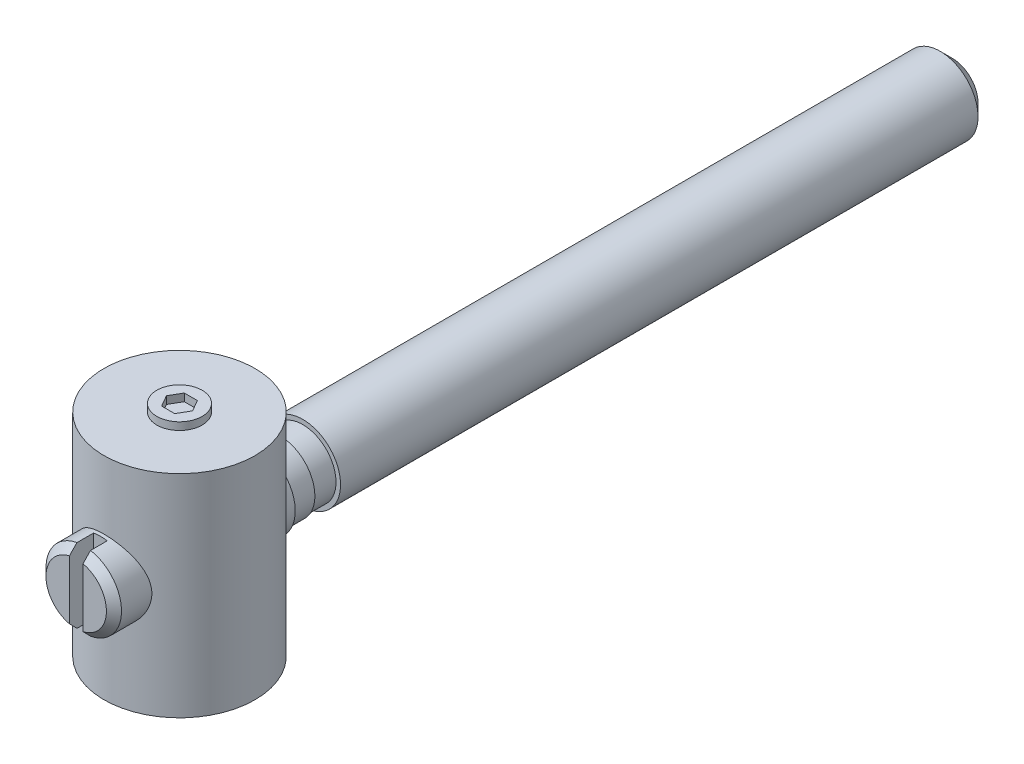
ISO-10303-21;
HEADER;
FILE_DESCRIPTION(('STEP AP214'),'2;1');
FILE_NAME('part.step','',(''),(''),'','','');
FILE_SCHEMA(('AUTOMOTIVE_DESIGN { 1 0 10303 214 1 1 1 1 }'));
ENDSEC;
DATA;
#1=APPLICATION_CONTEXT('core data for automotive mechanical design processes');
#2=APPLICATION_PROTOCOL_DEFINITION('international standard','automotive_design',2000,#1);
#3=PRODUCT_CONTEXT('',#1,'mechanical');
#4=PRODUCT('Part','Part','',(#3));
#5=PRODUCT_RELATED_PRODUCT_CATEGORY('part','',(#4));
#6=PRODUCT_DEFINITION_FORMATION('','',#4);
#7=PRODUCT_DEFINITION_CONTEXT('part definition',#1,'design');
#8=PRODUCT_DEFINITION('design','',#6,#7);
#9=PRODUCT_DEFINITION_SHAPE('','',#8);
#10=(LENGTH_UNIT() NAMED_UNIT(*) SI_UNIT(.MILLI.,.METRE.));
#11=(NAMED_UNIT(*) PLANE_ANGLE_UNIT() SI_UNIT($,.RADIAN.));
#12=(NAMED_UNIT(*) SI_UNIT($,.STERADIAN.) SOLID_ANGLE_UNIT());
#13=UNCERTAINTY_MEASURE_WITH_UNIT(LENGTH_MEASURE(1.E-05),#10,'distance_accuracy_value','');
#14=(GEOMETRIC_REPRESENTATION_CONTEXT(3) GLOBAL_UNCERTAINTY_ASSIGNED_CONTEXT((#13)) GLOBAL_UNIT_ASSIGNED_CONTEXT((#10,
#11,#12)) REPRESENTATION_CONTEXT('',''));
#15=CARTESIAN_POINT('',(0.,0.,0.));
#16=DIRECTION('',(0.,0.,1.));
#17=DIRECTION('',(1.,0.,0.));
#18=AXIS2_PLACEMENT_3D('',#15,#16,#17);
#19=CARTESIAN_POINT('',(0.,0.,6.8376561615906));
#20=DIRECTION('',(0.,0.,-1.));
#21=DIRECTION('',(0.,1.,0.));
#22=AXIS2_PLACEMENT_3D('',#19,#20,#21);
#23=PLANE('',#22);
#24=CARTESIAN_POINT('',(0.,0.,6.8376561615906));
#25=DIRECTION('',(0.,0.,-1.));
#26=DIRECTION('',(0.,1.,0.));
#27=AXIS2_PLACEMENT_3D('',#24,#25,#26);
#28=CIRCLE('',#27,2.);
#29=CARTESIAN_POINT('',(0.45,-1.94871752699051,6.8376561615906));
#30=VERTEX_POINT('',#29);
#31=CARTESIAN_POINT('',(0.45,1.94871752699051,6.8376561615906));
#32=VERTEX_POINT('',#31);
#33=EDGE_CURVE('E145',#30,#32,#28,.F.);
#34=ORIENTED_EDGE('',*,*,#33,.T.);
#35=DIRECTION('',(0.,1.,0.));
#36=VECTOR('',#35,1.);
#37=CARTESIAN_POINT('',(0.45,2.4591665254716,6.8376561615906));
#38=LINE('',#37,#36);
#39=EDGE_CURVE('E33',#30,#32,#38,.T.);
#40=ORIENTED_EDGE('',*,*,#39,.F.);
#41=EDGE_LOOP('',(#34,#40));
#42=FACE_BOUND('',#41,.T.);
#43=ADVANCED_FACE('F14',(#42),#23,.F.);
#44=CARTESIAN_POINT('',(-0.45,1.94871752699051,6.8376561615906));
#45=VERTEX_POINT('',#44);
#46=CARTESIAN_POINT('',(-0.45,-1.94871752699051,6.8376561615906));
#47=VERTEX_POINT('',#46);
#48=EDGE_CURVE('E134',#45,#47,#28,.F.);
#49=ORIENTED_EDGE('',*,*,#48,.T.);
#50=DIRECTION('',(0.,-1.,0.));
#51=VECTOR('',#50,1.);
#52=CARTESIAN_POINT('',(-0.45,2.4591665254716,6.8376561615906));
#53=LINE('',#52,#51);
#54=EDGE_CURVE('E297',#45,#47,#53,.T.);
#55=ORIENTED_EDGE('',*,*,#54,.F.);
#56=EDGE_LOOP('',(#49,#55));
#57=FACE_BOUND('',#56,.T.);
#58=ADVANCED_FACE('F181',(#57),#23,.F.);
#59=CARTESIAN_POINT('',(0.,0.,6.8376561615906));
#60=DIRECTION('',(0.,0.,-1.));
#61=DIRECTION('',(0.,1.,0.));
#62=AXIS2_PLACEMENT_3D('',#59,#60,#61);
#63=CONICAL_SURFACE('',#62,2.,0.785398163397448);
#64=CARTESIAN_POINT('',(0.45,-5.42557622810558,3.39345030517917));
#65=CARTESIAN_POINT('',(0.450000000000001,-5.23197486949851,3.58638323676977));
#66=CARTESIAN_POINT('',(0.450000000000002,-5.03834381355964,3.77928640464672));
#67=CARTESIAN_POINT('',(0.450000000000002,-4.65097063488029,4.16500261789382));
#68=CARTESIAN_POINT('',(0.450000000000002,-4.4572285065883,4.35781565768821));
#69=CARTESIAN_POINT('',(0.450000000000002,-4.06948715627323,4.74341479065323));
#70=CARTESIAN_POINT('',(0.450000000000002,-3.87548784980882,4.93620079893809));
#71=CARTESIAN_POINT('',(0.450000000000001,-3.48727998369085,5.32154115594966));
#72=CARTESIAN_POINT('',(0.450000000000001,-3.29307143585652,5.51409551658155));
#73=CARTESIAN_POINT('',(0.450000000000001,-2.91518099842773,5.88806787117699));
#74=CARTESIAN_POINT('',(0.450000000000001,-2.73151868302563,6.06950562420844));
#75=CARTESIAN_POINT('',(0.450000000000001,-2.45557699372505,6.34123708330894));
#76=CARTESIAN_POINT('',(0.450000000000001,-2.3635142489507,6.43175069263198));
#77=CARTESIAN_POINT('',(0.450000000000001,-2.17918444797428,6.6125669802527));
#78=CARTESIAN_POINT('',(0.450000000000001,-2.08691739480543,6.70286966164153));
#79=CARTESIAN_POINT('',(0.450000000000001,-1.90209588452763,6.8831607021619));
#80=CARTESIAN_POINT('',(0.450000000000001,-1.80954145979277,6.97314909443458));
#81=CARTESIAN_POINT('',(0.450000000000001,-1.62396889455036,7.15265715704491));
#82=CARTESIAN_POINT('',(0.450000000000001,-1.5309507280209,7.24217680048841));
#83=CARTESIAN_POINT('',(0.450000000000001,-1.34419825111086,7.42041554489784));
#84=CARTESIAN_POINT('',(0.450000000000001,-1.25046415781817,7.50913487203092));
#85=CARTESIAN_POINT('',(0.450000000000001,-1.10883677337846,7.64110521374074));
#86=CARTESIAN_POINT('',(0.450000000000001,-1.06145881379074,7.68490855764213));
#87=CARTESIAN_POINT('',(0.450000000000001,-0.966208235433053,7.77197331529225));
#88=CARTESIAN_POINT('',(0.45,-0.918335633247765,7.81523474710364));
#89=CARTESIAN_POINT('',(0.45,-0.843045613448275,7.88210740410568));
#90=CARTESIAN_POINT('',(0.450000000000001,-0.815880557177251,7.90600247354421));
#91=CARTESIAN_POINT('',(0.450000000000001,-0.761250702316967,7.95345109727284));
#92=CARTESIAN_POINT('',(0.450000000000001,-0.733785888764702,7.97700463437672));
#93=CARTESIAN_POINT('',(0.450000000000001,-0.678493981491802,8.02363326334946));
#94=CARTESIAN_POINT('',(0.450000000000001,-0.650667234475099,8.04670876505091));
#95=CARTESIAN_POINT('',(0.450000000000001,-0.594503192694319,8.09222815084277));
#96=CARTESIAN_POINT('',(0.45,-0.566165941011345,8.1146720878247));
#97=CARTESIAN_POINT('',(0.45,-0.508352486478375,8.15900200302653));
#98=CARTESIAN_POINT('',(0.450000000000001,-0.478865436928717,8.18087393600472));
#99=CARTESIAN_POINT('',(0.450000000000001,-0.418849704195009,8.22326079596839));
#100=CARTESIAN_POINT('',(0.450000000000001,-0.38831949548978,8.24377359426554));
#101=CARTESIAN_POINT('',(0.450000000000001,-0.326169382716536,8.28241108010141));
#102=CARTESIAN_POINT('',(0.450000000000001,-0.294562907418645,8.3005569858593));
#103=CARTESIAN_POINT('',(0.45,-0.22957953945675,8.33325387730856));
#104=CARTESIAN_POINT('',(0.45,-0.196208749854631,8.34781638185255));
#105=CARTESIAN_POINT('',(0.45,-0.135363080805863,8.36839183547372));
#106=CARTESIAN_POINT('',(0.450000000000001,-0.108310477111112,8.3756033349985));
#107=CARTESIAN_POINT('',(0.450000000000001,-0.0534100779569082,8.38529470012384));
#108=CARTESIAN_POINT('',(0.45,-0.0255652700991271,8.38779043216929));
#109=CARTESIAN_POINT('',(0.45,0.0301828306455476,8.38751005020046));
#110=CARTESIAN_POINT('',(0.450000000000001,0.0580860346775,8.38471745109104));
#111=CARTESIAN_POINT('',(0.450000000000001,0.113057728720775,8.37446707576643));
#112=CARTESIAN_POINT('',(0.45,0.14012323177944,8.36699426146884));
#113=CARTESIAN_POINT('',(0.45,0.195788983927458,8.34767787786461));
#114=CARTESIAN_POINT('',(0.45,0.224253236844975,8.33545861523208));
#115=CARTESIAN_POINT('',(0.450000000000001,0.279866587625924,8.30828364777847));
#116=CARTESIAN_POINT('',(0.450000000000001,0.307012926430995,8.293322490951));
#117=CARTESIAN_POINT('',(0.450000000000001,0.36045252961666,8.26149435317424));
#118=CARTESIAN_POINT('',(0.450000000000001,0.386736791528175,8.24461251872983));
#119=CARTESIAN_POINT('',(0.45,0.438454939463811,8.20965869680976));
#120=CARTESIAN_POINT('',(0.45,0.463889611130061,8.191587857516));
#121=CARTESIAN_POINT('',(0.45,0.516620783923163,8.15278577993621));
#122=CARTESIAN_POINT('',(0.45,0.543853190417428,8.13196802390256));
#123=CARTESIAN_POINT('',(0.450000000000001,0.59776579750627,8.08962702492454));
#124=CARTESIAN_POINT('',(0.45,0.624445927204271,8.06810369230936));
#125=CARTESIAN_POINT('',(0.45,0.703891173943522,8.00276414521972));
#126=CARTESIAN_POINT('',(0.45,0.756036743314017,7.95819695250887));
#127=CARTESIAN_POINT('',(0.45,0.85942630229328,7.86786663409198));
#128=CARTESIAN_POINT('',(0.45,0.910668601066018,7.82210159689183));
#129=CARTESIAN_POINT('',(0.45,1.01249538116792,7.72987380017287));
#130=CARTESIAN_POINT('',(0.45,1.06308003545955,7.6834112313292));
#131=CARTESIAN_POINT('',(0.45,1.16360564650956,7.59020812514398));
#132=CARTESIAN_POINT('',(0.45,1.21354839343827,7.54346951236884));
#133=CARTESIAN_POINT('',(0.45,1.3131284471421,7.44966163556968));
#134=CARTESIAN_POINT('',(0.45,1.36276573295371,7.40259234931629));
#135=CARTESIAN_POINT('',(0.45,1.51124171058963,7.26112807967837));
#136=CARTESIAN_POINT('',(0.45,1.6097456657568,7.16638213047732));
#137=CARTESIAN_POINT('',(0.45,1.8645669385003,6.91997152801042));
#138=CARTESIAN_POINT('',(0.45,2.02049383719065,6.76790421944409));
#139=CARTESIAN_POINT('',(0.45,2.33171348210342,6.46311867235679));
#140=CARTESIAN_POINT('',(0.45,2.4870062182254,6.31040042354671));
#141=CARTESIAN_POINT('',(0.45,2.79729282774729,6.00451859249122));
#142=CARTESIAN_POINT('',(0.45,2.95228653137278,5.85135483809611));
#143=CARTESIAN_POINT('',(0.45,3.26204211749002,5.54479507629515));
#144=CARTESIAN_POINT('',(0.45,3.41680400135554,5.39139907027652));
#145=CARTESIAN_POINT('',(0.45,3.88099551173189,4.93085423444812));
#146=CARTESIAN_POINT('',(0.45,4.19019976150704,4.62347828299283));
#147=CARTESIAN_POINT('',(0.449999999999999,4.65370644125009,4.1622668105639));
#148=CARTESIAN_POINT('',(0.449999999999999,4.80812040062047,4.0085432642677));
#149=CARTESIAN_POINT('',(0.449999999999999,5.116888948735,3.70103724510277));
#150=CARTESIAN_POINT('',(0.45,5.27124353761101,3.54725477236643));
#151=CARTESIAN_POINT('',(0.45,5.42557622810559,3.39345030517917));
#152=B_SPLINE_CURVE_WITH_KNOTS('',3,(#64,#65,#66,#67,#68,#69,#70,#71,#72,#73,#74,#75,#76,#77,
#78,#79,#80,#81,#82,#83,#84,#85,#86,#87,#88,#89,#90,#91,#92,#93,#94,#95,#96,#97,#98,#99,#100,
#101,#102,#103,#104,#105,#106,#107,#108,#109,#110,#111,#112,#113,#114,#115,#116,#117,#118,#119,
#120,#121,#122,#123,#124,#125,#126,#127,#128,#129,#130,#131,#132,#133,#134,#135,#136,#137,#138,
#139,#140,#141,#142,#143,#144,#145,#146,#147,#148,#149,#150,#151),.UNSPECIFIED.,.F.,.F.,(4,2,2,
2,2,2,2,2,2,2,2,2,2,2,2,2,2,2,2,2,2,2,2,2,2,2,2,2,2,2,2,2,2,2,2,2,2,2,2,2,2,2,2,4),(0.,
0.819964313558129,1.63997398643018,2.46047345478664,3.28092878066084,4.05543648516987,
4.4427531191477,4.83006404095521,5.21733280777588,5.60462355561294,5.99180119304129,
6.18537215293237,6.37893664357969,6.48747135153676,6.59601150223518,6.70445438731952,
6.81288816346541,6.92300307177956,7.03328655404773,7.14250119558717,7.25136004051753,
7.33503215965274,7.41842225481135,7.50207272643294,7.58599336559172,7.67870028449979,
7.77159358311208,7.86526158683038,7.95884042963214,8.06165788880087,8.16448846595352,
8.37024155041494,8.57634583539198,8.78239477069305,8.98759769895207,9.19281455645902,
9.60283291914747,10.2562345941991,10.9096466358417,11.5633584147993,12.2170663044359,
13.5250356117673,14.1786956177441,14.8323541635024),.UNSPECIFIED.);
#153=CARTESIAN_POINT('',(0.45,-2.4591665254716,6.3376561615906));
#154=VERTEX_POINT('',#153);
#155=EDGE_CURVE('E161',#154,#30,#152,.T.);
#156=ORIENTED_EDGE('',*,*,#155,.F.);
#157=CARTESIAN_POINT('',(0.,0.,6.3376561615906));
#158=DIRECTION('',(0.,0.,-1.));
#159=DIRECTION('',(0.,1.,0.));
#160=AXIS2_PLACEMENT_3D('',#157,#158,#159);
#161=CIRCLE('',#160,2.5);
#162=CARTESIAN_POINT('',(0.45,2.4591665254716,6.3376561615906));
#163=VERTEX_POINT('',#162);
#164=EDGE_CURVE('E141',#163,#154,#161,.T.);
#165=ORIENTED_EDGE('',*,*,#164,.F.);
#166=EDGE_CURVE('E154',#32,#163,#152,.T.);
#167=ORIENTED_EDGE('',*,*,#166,.F.);
#168=ORIENTED_EDGE('',*,*,#33,.F.);
#169=EDGE_LOOP('',(#156,#165,#167,#168));
#170=FACE_BOUND('',#169,.T.);
#171=ADVANCED_FACE('F168',(#170),#63,.T.);
#172=CARTESIAN_POINT('',(0.45,2.4591665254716,5.2376561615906));
#173=DIRECTION('',(1.,0.,0.));
#174=DIRECTION('',(0.,1.,0.));
#175=AXIS2_PLACEMENT_3D('',#172,#173,#174);
#176=PLANE('',#175);
#177=ORIENTED_EDGE('',*,*,#155,.T.);
#178=ORIENTED_EDGE('',*,*,#39,.T.);
#179=ORIENTED_EDGE('',*,*,#166,.T.);
#180=DIRECTION('',(0.,0.,1.));
#181=VECTOR('',#180,1.);
#182=CARTESIAN_POINT('',(0.45,2.4591665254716,5.2376561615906));
#183=LINE('',#182,#181);
#184=CARTESIAN_POINT('',(0.45,2.4591665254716,5.2376561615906));
#185=VERTEX_POINT('',#184);
#186=EDGE_CURVE('E125',#185,#163,#183,.T.);
#187=ORIENTED_EDGE('',*,*,#186,.F.);
#188=DIRECTION('',(0.,1.,0.));
#189=VECTOR('',#188,1.);
#190=CARTESIAN_POINT('',(0.45,2.4591665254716,5.2376561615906));
#191=LINE('',#190,#189);
#192=CARTESIAN_POINT('',(0.45,-2.4591665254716,5.2376561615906));
#193=VERTEX_POINT('',#192);
#194=EDGE_CURVE('E89',#193,#185,#191,.T.);
#195=ORIENTED_EDGE('',*,*,#194,.F.);
#196=DIRECTION('',(0.,0.,1.));
#197=VECTOR('',#196,1.);
#198=CARTESIAN_POINT('',(0.45,-2.4591665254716,5.2376561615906));
#199=LINE('',#198,#197);
#200=EDGE_CURVE('E308',#193,#154,#199,.T.);
#201=ORIENTED_EDGE('',*,*,#200,.T.);
#202=EDGE_LOOP('',(#177,#178,#179,#187,#195,#201));
#203=FACE_BOUND('',#202,.T.);
#204=ADVANCED_FACE('F172',(#203),#176,.F.);
#205=CARTESIAN_POINT('',(0.,0.,5.2376561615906));
#206=DIRECTION('',(0.,0.,1.));
#207=DIRECTION('',(0.,-1.,0.));
#208=AXIS2_PLACEMENT_3D('',#205,#206,#207);
#209=PLANE('',#208);
#210=CARTESIAN_POINT('',(0.,0.,5.2376561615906));
#211=DIRECTION('',(0.,0.,1.));
#212=DIRECTION('',(0.,-1.,0.));
#213=AXIS2_PLACEMENT_3D('',#210,#211,#212);
#214=CIRCLE('',#213,2.5);
#215=CARTESIAN_POINT('',(-0.45,-2.4591665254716,5.2376561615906));
#216=VERTEX_POINT('',#215);
#217=EDGE_CURVE('E299',#216,#193,#214,.T.);
#218=ORIENTED_EDGE('',*,*,#217,.T.);
#219=ORIENTED_EDGE('',*,*,#194,.T.);
#220=CARTESIAN_POINT('',(0.,0.,5.2376561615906));
#221=DIRECTION('',(0.,0.,1.));
#222=DIRECTION('',(0.,-1.,0.));
#223=AXIS2_PLACEMENT_3D('',#220,#221,#222);
#224=CIRCLE('',#223,2.5);
#225=CARTESIAN_POINT('',(-0.45,2.4591665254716,5.2376561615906));
#226=VERTEX_POINT('',#225);
#227=EDGE_CURVE('E333',#185,#226,#224,.T.);
#228=ORIENTED_EDGE('',*,*,#227,.T.);
#229=DIRECTION('',(0.,-1.,0.));
#230=VECTOR('',#229,1.);
#231=CARTESIAN_POINT('',(-0.45,2.4591665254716,5.2376561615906));
#232=LINE('',#231,#230);
#233=EDGE_CURVE('E120',#226,#216,#232,.T.);
#234=ORIENTED_EDGE('',*,*,#233,.T.);
#235=EDGE_LOOP('',(#218,#219,#228,#234));
#236=FACE_BOUND('',#235,.T.);
#237=ADVANCED_FACE('F176',(#236),#209,.T.);
#238=CARTESIAN_POINT('',(-0.45,2.4591665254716,5.2376561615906));
#239=DIRECTION('',(-1.,0.,0.));
#240=DIRECTION('',(0.,-1.,0.));
#241=AXIS2_PLACEMENT_3D('',#238,#239,#240);
#242=PLANE('',#241);
#243=CARTESIAN_POINT('',(-0.45,5.42557622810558,3.39345030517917));
#244=CARTESIAN_POINT('',(-0.45,5.23197486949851,3.58638323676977));
#245=CARTESIAN_POINT('',(-0.45,5.03834381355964,3.77928640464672));
#246=CARTESIAN_POINT('',(-0.45,4.65097063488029,4.16500261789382));
#247=CARTESIAN_POINT('',(-0.45,4.4572285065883,4.35781565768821));
#248=CARTESIAN_POINT('',(-0.45,4.06948715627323,4.74341479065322));
#249=CARTESIAN_POINT('',(-0.45,3.87548784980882,4.93620079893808));
#250=CARTESIAN_POINT('',(-0.45,3.48727998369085,5.32154115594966));
#251=CARTESIAN_POINT('',(-0.45,3.29307143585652,5.51409551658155));
#252=CARTESIAN_POINT('',(-0.45,2.91518099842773,5.88806787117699));
#253=CARTESIAN_POINT('',(-0.45,2.73151868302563,6.06950562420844));
#254=CARTESIAN_POINT('',(-0.45,2.45557699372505,6.34123708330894));
#255=CARTESIAN_POINT('',(-0.45,2.3635142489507,6.43175069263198));
#256=CARTESIAN_POINT('',(-0.45,2.17918444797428,6.6125669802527));
#257=CARTESIAN_POINT('',(-0.45,2.08691739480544,6.70286966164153));
#258=CARTESIAN_POINT('',(-0.45,1.90209588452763,6.8831607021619));
#259=CARTESIAN_POINT('',(-0.45,1.80954145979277,6.97314909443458));
#260=CARTESIAN_POINT('',(-0.45,1.62396889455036,7.15265715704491));
#261=CARTESIAN_POINT('',(-0.45,1.5309507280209,7.24217680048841));
#262=CARTESIAN_POINT('',(-0.45,1.34419825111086,7.42041554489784));
#263=CARTESIAN_POINT('',(-0.45,1.25046415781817,7.50913487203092));
#264=CARTESIAN_POINT('',(-0.45,1.10883677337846,7.64110521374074));
#265=CARTESIAN_POINT('',(-0.45,1.06145881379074,7.68490855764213));
#266=CARTESIAN_POINT('',(-0.45,0.966208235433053,7.77197331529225));
#267=CARTESIAN_POINT('',(-0.45,0.918335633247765,7.81523474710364));
#268=CARTESIAN_POINT('',(-0.45,0.843045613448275,7.88210740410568));
#269=CARTESIAN_POINT('',(-0.45,0.815880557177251,7.90600247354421));
#270=CARTESIAN_POINT('',(-0.45,0.761250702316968,7.95345109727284));
#271=CARTESIAN_POINT('',(-0.45,0.733785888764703,7.97700463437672));
#272=CARTESIAN_POINT('',(-0.45,0.678493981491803,8.02363326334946));
#273=CARTESIAN_POINT('',(-0.45,0.6506672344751,8.04670876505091));
#274=CARTESIAN_POINT('',(-0.45,0.594503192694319,8.09222815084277));
#275=CARTESIAN_POINT('',(-0.45,0.566165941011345,8.1146720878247));
#276=CARTESIAN_POINT('',(-0.45,0.508352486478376,8.15900200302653));
#277=CARTESIAN_POINT('',(-0.45,0.478865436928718,8.18087393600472));
#278=CARTESIAN_POINT('',(-0.45,0.41884970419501,8.22326079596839));
#279=CARTESIAN_POINT('',(-0.45,0.388319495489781,8.24377359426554));
#280=CARTESIAN_POINT('',(-0.45,0.326169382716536,8.28241108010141));
#281=CARTESIAN_POINT('',(-0.45,0.294562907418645,8.30055698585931));
#282=CARTESIAN_POINT('',(-0.45,0.22957953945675,8.33325387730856));
#283=CARTESIAN_POINT('',(-0.45,0.196208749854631,8.34781638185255));
#284=CARTESIAN_POINT('',(-0.45,0.135363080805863,8.36839183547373));
#285=CARTESIAN_POINT('',(-0.45,0.108310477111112,8.3756033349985));
#286=CARTESIAN_POINT('',(-0.45,0.0534100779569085,8.38529470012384));
#287=CARTESIAN_POINT('',(-0.45,0.0255652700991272,8.38779043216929));
#288=CARTESIAN_POINT('',(-0.45,-0.0301828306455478,8.38751005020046));
#289=CARTESIAN_POINT('',(-0.45,-0.0580860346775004,8.38471745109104));
#290=CARTESIAN_POINT('',(-0.45,-0.113057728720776,8.37446707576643));
#291=CARTESIAN_POINT('',(-0.45,-0.14012323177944,8.36699426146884));
#292=CARTESIAN_POINT('',(-0.45,-0.195788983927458,8.34767787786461));
#293=CARTESIAN_POINT('',(-0.45,-0.224253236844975,8.33545861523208));
#294=CARTESIAN_POINT('',(-0.45,-0.279866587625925,8.30828364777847));
#295=CARTESIAN_POINT('',(-0.45,-0.307012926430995,8.293322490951));
#296=CARTESIAN_POINT('',(-0.45,-0.36045252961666,8.26149435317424));
#297=CARTESIAN_POINT('',(-0.45,-0.386736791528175,8.24461251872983));
#298=CARTESIAN_POINT('',(-0.45,-0.438454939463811,8.20965869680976));
#299=CARTESIAN_POINT('',(-0.45,-0.463889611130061,8.191587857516));
#300=CARTESIAN_POINT('',(-0.45,-0.516620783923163,8.15278577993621));
#301=CARTESIAN_POINT('',(-0.45,-0.543853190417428,8.13196802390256));
#302=CARTESIAN_POINT('',(-0.45,-0.597765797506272,8.08962702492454));
#303=CARTESIAN_POINT('',(-0.45,-0.624445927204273,8.06810369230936));
#304=CARTESIAN_POINT('',(-0.45,-0.703891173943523,8.00276414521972));
#305=CARTESIAN_POINT('',(-0.45,-0.756036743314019,7.95819695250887));
#306=CARTESIAN_POINT('',(-0.45,-0.859426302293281,7.86786663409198));
#307=CARTESIAN_POINT('',(-0.45,-0.910668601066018,7.82210159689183));
#308=CARTESIAN_POINT('',(-0.45,-1.01249538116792,7.72987380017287));
#309=CARTESIAN_POINT('',(-0.45,-1.06308003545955,7.6834112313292));
#310=CARTESIAN_POINT('',(-0.45,-1.16360564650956,7.59020812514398));
#311=CARTESIAN_POINT('',(-0.45,-1.21354839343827,7.54346951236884));
#312=CARTESIAN_POINT('',(-0.45,-1.3131284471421,7.44966163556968));
#313=CARTESIAN_POINT('',(-0.45,-1.36276573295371,7.40259234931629));
#314=CARTESIAN_POINT('',(-0.45,-1.51124171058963,7.26112807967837));
#315=CARTESIAN_POINT('',(-0.45,-1.6097456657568,7.16638213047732));
#316=CARTESIAN_POINT('',(-0.45,-1.8645669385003,6.91997152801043));
#317=CARTESIAN_POINT('',(-0.45,-2.02049383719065,6.76790421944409));
#318=CARTESIAN_POINT('',(-0.45,-2.33171348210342,6.46311867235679));
#319=CARTESIAN_POINT('',(-0.45,-2.4870062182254,6.31040042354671));
#320=CARTESIAN_POINT('',(-0.45,-2.79729282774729,6.00451859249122));
#321=CARTESIAN_POINT('',(-0.45,-2.95228653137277,5.85135483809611));
#322=CARTESIAN_POINT('',(-0.45,-3.26204211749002,5.54479507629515));
#323=CARTESIAN_POINT('',(-0.45,-3.41680400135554,5.39139907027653));
#324=CARTESIAN_POINT('',(-0.45,-3.88099551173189,4.93085423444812));
#325=CARTESIAN_POINT('',(-0.45,-4.19019976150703,4.62347828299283));
#326=CARTESIAN_POINT('',(-0.45,-4.65370644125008,4.1622668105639));
#327=CARTESIAN_POINT('',(-0.45,-4.80812040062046,4.00854326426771));
#328=CARTESIAN_POINT('',(-0.45,-5.116888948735,3.70103724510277));
#329=CARTESIAN_POINT('',(-0.45,-5.27124353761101,3.54725477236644));
#330=CARTESIAN_POINT('',(-0.45,-5.42557622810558,3.39345030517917));
#331=B_SPLINE_CURVE_WITH_KNOTS('',3,(#243,#244,#245,#246,#247,#248,#249,#250,#251,#252,#253,
#254,#255,#256,#257,#258,#259,#260,#261,#262,#263,#264,#265,#266,#267,#268,#269,#270,#271,#272,
#273,#274,#275,#276,#277,#278,#279,#280,#281,#282,#283,#284,#285,#286,#287,#288,#289,#290,#291,
#292,#293,#294,#295,#296,#297,#298,#299,#300,#301,#302,#303,#304,#305,#306,#307,#308,#309,#310,
#311,#312,#313,#314,#315,#316,#317,#318,#319,#320,#321,#322,#323,#324,#325,#326,#327,#328,#329,
#330),.UNSPECIFIED.,.F.,.F.,(4,2,2,2,2,2,2,2,2,2,2,2,2,2,2,2,2,2,2,2,2,2,2,2,2,2,2,2,2,2,2,2,2,
2,2,2,2,2,2,2,2,2,2,4),(0.,0.819964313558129,1.63997398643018,2.46047345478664,3.28092878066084,
4.05543648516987,4.4427531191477,4.83006404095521,5.21733280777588,5.60462355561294,
5.99180119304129,6.18537215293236,6.37893664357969,6.48747135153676,6.59601150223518,
6.70445438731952,6.81288816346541,6.92300307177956,7.03328655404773,7.14250119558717,
7.25136004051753,7.33503215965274,7.41842225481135,7.50207272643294,7.58599336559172,
7.67870028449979,7.77159358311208,7.86526158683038,7.95884042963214,8.06165788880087,
8.16448846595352,8.37024155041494,8.57634583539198,8.78239477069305,8.98759769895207,
9.19281455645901,9.60283291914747,10.2562345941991,10.9096466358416,11.5633584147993,
12.2170663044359,13.5250356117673,14.1786956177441,14.8323541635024),.UNSPECIFIED.);
#332=CARTESIAN_POINT('',(-0.45,2.4591665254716,6.3376561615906));
#333=VERTEX_POINT('',#332);
#334=EDGE_CURVE('E117',#333,#45,#331,.T.);
#335=ORIENTED_EDGE('',*,*,#334,.T.);
#336=ORIENTED_EDGE('',*,*,#54,.T.);
#337=CARTESIAN_POINT('',(-0.45,-2.4591665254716,6.3376561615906));
#338=VERTEX_POINT('',#337);
#339=EDGE_CURVE('E135',#47,#338,#331,.T.);
#340=ORIENTED_EDGE('',*,*,#339,.T.);
#341=DIRECTION('',(0.,0.,1.));
#342=VECTOR('',#341,1.);
#343=CARTESIAN_POINT('',(-0.45,-2.4591665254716,5.2376561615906));
#344=LINE('',#343,#342);
#345=EDGE_CURVE('E124',#216,#338,#344,.T.);
#346=ORIENTED_EDGE('',*,*,#345,.F.);
#347=ORIENTED_EDGE('',*,*,#233,.F.);
#348=DIRECTION('',(0.,0.,1.));
#349=VECTOR('',#348,1.);
#350=CARTESIAN_POINT('',(-0.45,2.4591665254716,5.2376561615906));
#351=LINE('',#350,#349);
#352=EDGE_CURVE('E114',#226,#333,#351,.T.);
#353=ORIENTED_EDGE('',*,*,#352,.T.);
#354=EDGE_LOOP('',(#335,#336,#340,#346,#347,#353));
#355=FACE_BOUND('',#354,.T.);
#356=ADVANCED_FACE('F116',(#355),#242,.F.);
#357=ORIENTED_EDGE('',*,*,#334,.F.);
#358=EDGE_CURVE('E132',#338,#333,#161,.T.);
#359=ORIENTED_EDGE('',*,*,#358,.F.);
#360=ORIENTED_EDGE('',*,*,#339,.F.);
#361=ORIENTED_EDGE('',*,*,#48,.F.);
#362=EDGE_LOOP('',(#357,#359,#360,#361));
#363=FACE_BOUND('',#362,.T.);
#364=ADVANCED_FACE('F130',(#363),#63,.T.);
#365=CARTESIAN_POINT('',(0.,0.,37.1330220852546));
#366=DIRECTION('',(0.,0.,1.));
#367=DIRECTION('',(0.,-1.,0.));
#368=AXIS2_PLACEMENT_3D('',#365,#366,#367);
#369=CYLINDRICAL_SURFACE('',#368,2.5);
#370=ORIENTED_EDGE('',*,*,#358,.T.);
#371=ORIENTED_EDGE('',*,*,#352,.F.);
#372=ORIENTED_EDGE('',*,*,#227,.F.);
#373=ORIENTED_EDGE('',*,*,#186,.T.);
#374=ORIENTED_EDGE('',*,*,#164,.T.);
#375=ORIENTED_EDGE('',*,*,#200,.F.);
#376=ORIENTED_EDGE('',*,*,#217,.F.);
#377=ORIENTED_EDGE('',*,*,#345,.T.);
#378=EDGE_LOOP('',(#370,#371,#372,#373,#374,#375,#376,#377));
#379=FACE_BOUND('',#378,.T.);
#380=CARTESIAN_POINT('',(0.,-2.5,5.));
#381=CARTESIAN_POINT('',(-0.131426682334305,-2.49999033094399,4.99999177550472));
#382=CARTESIAN_POINT('',(-0.263015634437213,-2.48957443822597,4.99476199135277));
#383=CARTESIAN_POINT('',(-0.522301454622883,-2.44836817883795,4.9743541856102));
#384=CARTESIAN_POINT('',(-0.649990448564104,-2.41753911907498,4.9591572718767));
#385=CARTESIAN_POINT('',(-0.897333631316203,-2.33701537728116,4.92040690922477));
#386=CARTESIAN_POINT('',(-1.01701694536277,-2.28739401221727,4.89688595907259));
#387=CARTESIAN_POINT('',(-1.24618160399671,-2.1710734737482,4.84364443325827));
#388=CARTESIAN_POINT('',(-1.3556637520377,-2.10437564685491,4.81392434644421));
#389=CARTESIAN_POINT('',(-1.56876952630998,-1.95120686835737,4.74890645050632));
#390=CARTESIAN_POINT('',(-1.67163802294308,-1.86378379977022,4.71337997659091));
#391=CARTESIAN_POINT('',(-1.86194861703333,-1.67369630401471,4.64149925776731));
#392=CARTESIAN_POINT('',(-1.94937895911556,-1.57102037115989,4.60514440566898));
#393=CARTESIAN_POINT('',(-2.11312999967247,-1.34379162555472,4.53247377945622));
#394=CARTESIAN_POINT('',(-2.18806333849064,-1.21815975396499,4.49637967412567));
#395=CARTESIAN_POINT('',(-2.31542056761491,-0.954081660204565,4.43214946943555));
#396=CARTESIAN_POINT('',(-2.36786053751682,-0.815644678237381,4.40400769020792));
#397=CARTESIAN_POINT('',(-2.44533110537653,-0.538337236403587,4.36144667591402));
#398=CARTESIAN_POINT('',(-2.47181464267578,-0.399988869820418,4.34630678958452));
#399=CARTESIAN_POINT('',(-2.50106748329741,-0.120052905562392,4.3295472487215));
#400=CARTESIAN_POINT('',(-2.50386022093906,0.0215313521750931,4.3279142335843));
#401=CARTESIAN_POINT('',(-2.48671821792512,0.285715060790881,4.33777325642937));
#402=CARTESIAN_POINT('',(-2.46946139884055,0.408560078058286,4.34771909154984));
#403=CARTESIAN_POINT('',(-2.41734962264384,0.649304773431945,4.37690571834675));
#404=CARTESIAN_POINT('',(-2.38248905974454,0.767202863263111,4.39614947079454));
#405=CARTESIAN_POINT('',(-2.29552445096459,0.998072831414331,4.44218691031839));
#406=CARTESIAN_POINT('',(-2.24303766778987,1.11086599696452,4.46914601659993));
#407=CARTESIAN_POINT('',(-2.12260421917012,1.32658573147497,4.52758510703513));
#408=CARTESIAN_POINT('',(-2.0546506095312,1.42950783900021,4.55906711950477));
#409=CARTESIAN_POINT('',(-1.89516513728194,1.63630313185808,4.62782894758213));
#410=CARTESIAN_POINT('',(-1.8017361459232,1.7386421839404,4.66533775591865));
#411=CARTESIAN_POINT('',(-1.59888894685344,1.92683854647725,4.73869058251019));
#412=CARTESIAN_POINT('',(-1.48946314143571,2.01268798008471,4.77453379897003));
#413=CARTESIAN_POINT('',(-1.25129126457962,2.16921415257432,4.84254968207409));
#414=CARTESIAN_POINT('',(-1.12188397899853,2.23900118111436,4.87447460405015));
#415=CARTESIAN_POINT('',(-0.851165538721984,2.35524257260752,4.92894702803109));
#416=CARTESIAN_POINT('',(-0.709863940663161,2.4017154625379,4.95150197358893));
#417=CARTESIAN_POINT('',(-0.431916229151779,2.46618850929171,4.98310834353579));
#418=CARTESIAN_POINT('',(-0.295853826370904,2.486228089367,4.9931234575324));
#419=CARTESIAN_POINT('',(-0.0219489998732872,2.50366182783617,5.00182533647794));
#420=CARTESIAN_POINT('',(0.11589254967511,2.50106671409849,5.00051746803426));
#421=CARTESIAN_POINT('',(0.378082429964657,2.4744832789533,4.98727980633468));
#422=CARTESIAN_POINT('',(0.502648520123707,2.45216866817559,4.97618114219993));
#423=CARTESIAN_POINT('',(0.746017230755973,2.38940482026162,4.94555428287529));
#424=CARTESIAN_POINT('',(0.864819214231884,2.34895358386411,4.92602515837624));
#425=CARTESIAN_POINT('',(1.09722152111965,2.25000383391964,4.87960628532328));
#426=CARTESIAN_POINT('',(1.21057599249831,2.19102237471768,4.85252204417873));
#427=CARTESIAN_POINT('',(1.42615340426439,2.05723116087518,4.7935993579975));
#428=CARTESIAN_POINT('',(1.52837157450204,1.98241466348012,4.76175888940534));
#429=CARTESIAN_POINT('',(1.72941922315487,1.81059893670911,4.69270553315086));
#430=CARTESIAN_POINT('',(1.82693019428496,1.7121428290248,4.65527212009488));
#431=CARTESIAN_POINT('',(2.0046408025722,1.50018712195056,4.58155978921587));
#432=CARTESIAN_POINT('',(2.08482846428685,1.38667720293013,4.54528168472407));
#433=CARTESIAN_POINT('',(2.22926978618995,1.14089086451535,4.4762798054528));
#434=CARTESIAN_POINT('',(2.29256373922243,1.00797183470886,4.44381323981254));
#435=CARTESIAN_POINT('',(2.39520706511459,0.731224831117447,4.38935180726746));
#436=CARTESIAN_POINT('',(2.43458729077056,0.587411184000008,4.36734345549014));
#437=CARTESIAN_POINT('',(2.48465421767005,0.307724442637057,4.33903752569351));
#438=CARTESIAN_POINT('',(2.4977324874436,0.172414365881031,4.33143458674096));
#439=CARTESIAN_POINT('',(2.50172288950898,-0.0986176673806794,4.32913386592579));
#440=CARTESIAN_POINT('',(2.49264462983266,-0.23433941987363,4.3344304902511));
#441=CARTESIAN_POINT('',(2.45481530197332,-0.488708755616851,4.35594655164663));
#442=CARTESIAN_POINT('',(2.42802074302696,-0.607751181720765,4.37107736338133));
#443=CARTESIAN_POINT('',(2.35793843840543,-0.839520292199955,4.40927540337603));
#444=CARTESIAN_POINT('',(2.31464538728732,-0.952244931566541,4.43234518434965));
#445=CARTESIAN_POINT('',(2.20953919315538,-1.17656215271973,4.48571326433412));
#446=CARTESIAN_POINT('',(2.14667719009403,-1.28756985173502,4.5163930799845));
#447=CARTESIAN_POINT('',(2.0053780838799,-1.49818624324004,4.58088327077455));
#448=CARTESIAN_POINT('',(1.92693287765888,-1.59778896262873,4.61469526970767));
#449=CARTESIAN_POINT('',(1.74550556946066,-1.79535536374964,4.68655816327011));
#450=CARTESIAN_POINT('',(1.6407002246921,-1.89164936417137,4.72462491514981));
#451=CARTESIAN_POINT('',(1.41539785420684,-2.06565584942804,4.79694347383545));
#452=CARTESIAN_POINT('',(1.29489242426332,-2.14335831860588,4.83119321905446));
#453=CARTESIAN_POINT('',(1.03978808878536,-2.2780969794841,4.89245149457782));
#454=CARTESIAN_POINT('',(0.905095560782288,-2.33498316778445,4.91940711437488));
#455=CARTESIAN_POINT('',(0.696328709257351,-2.4021838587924,4.95177960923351));
#456=CARTESIAN_POINT('',(0.625670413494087,-2.42155539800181,4.96122314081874));
#457=CARTESIAN_POINT('',(0.482623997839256,-2.4540659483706,4.97717127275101));
#458=CARTESIAN_POINT('',(0.4102369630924,-2.46720876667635,4.98367766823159));
#459=CARTESIAN_POINT('',(0.28151868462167,-2.48473747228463,4.9923820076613));
#460=CARTESIAN_POINT('',(0.225408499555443,-2.49045493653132,4.99523288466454));
#461=CARTESIAN_POINT('',(0.112875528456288,-2.49808832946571,4.99904367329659));
#462=CARTESIAN_POINT('',(0.0564527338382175,-2.50000415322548,5.00000353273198));
#463=CARTESIAN_POINT('',(0.,-2.5,5.));
#464=B_SPLINE_CURVE_WITH_KNOTS('',3,(#380,#381,#382,#383,#384,#385,#386,#387,#388,#389,#390,
#391,#392,#393,#394,#395,#396,#397,#398,#399,#400,#401,#402,#403,#404,#405,#406,#407,#408,#409,
#410,#411,#412,#413,#414,#415,#416,#417,#418,#419,#420,#421,#422,#423,#424,#425,#426,#427,#428,
#429,#430,#431,#432,#433,#434,#435,#436,#437,#438,#439,#440,#441,#442,#443,#444,#445,#446,#447,
#448,#449,#450,#451,#452,#453,#454,#455,#456,#457,#458,#459,#460,#461,#462,#463),.UNSPECIFIED.,
.T.,.F.,(4,2,2,2,2,2,2,2,2,2,2,2,2,2,2,2,2,2,2,2,2,2,2,2,2,2,2,2,2,2,2,2,2,2,2,2,2,2,2,2,2,4),
(0.,0.394060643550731,0.788870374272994,1.18215538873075,1.57540940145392,1.99245439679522,
2.40981559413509,2.85954316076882,3.30894869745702,3.73145030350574,4.15353393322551,
4.52514281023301,4.89687009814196,5.27725600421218,5.65781303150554,6.08662353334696,
6.51563836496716,6.96457555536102,7.41315542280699,7.82458226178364,8.2358141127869,
8.61517266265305,8.99457304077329,9.38482140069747,9.77523626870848,10.2039902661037,
10.6330397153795,11.0828670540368,11.53211279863,11.9382326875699,12.3441764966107,
12.7114482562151,13.0788382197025,13.4709114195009,13.8631890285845,14.303131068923,
14.7433095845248,15.1866003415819,15.407934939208,15.6291340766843,15.7983933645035,
15.9676573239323),.UNSPECIFIED.);
#465=CARTESIAN_POINT('',(0.,-2.5,5.));
#466=VERTEX_POINT('',#465);
#467=EDGE_CURVE('E24',#466,#466,#464,.T.);
#468=ORIENTED_EDGE('',*,*,#467,.F.);
#469=EDGE_LOOP('',(#468));
#470=FACE_BOUND('',#469,.T.);
#471=ADVANCED_FACE('F138',(#379,#470),#369,.T.);
#472=CARTESIAN_POINT('',(0.,7.,0.));
#473=DIRECTION('',(0.,1.,0.));
#474=DIRECTION('',(-1.,0.,0.));
#475=AXIS2_PLACEMENT_3D('',#472,#473,#474);
#476=PLANE('',#475);
#477=DIRECTION('',(-1.,0.,0.));
#478=VECTOR('',#477,1.);
#479=CARTESIAN_POINT('',(-0.43301270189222,7.,0.75));
#480=LINE('',#479,#478);
#481=CARTESIAN_POINT('',(0.43301270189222,7.,0.75));
#482=VERTEX_POINT('',#481);
#483=CARTESIAN_POINT('',(-0.433012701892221,7.,0.75));
#484=VERTEX_POINT('',#483);
#485=EDGE_CURVE('E561',#482,#484,#480,.T.);
#486=ORIENTED_EDGE('',*,*,#485,.F.);
#487=DIRECTION('',(-0.5,0.,0.866025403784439));
#488=VECTOR('',#487,1.);
#489=CARTESIAN_POINT('',(0.43301270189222,7.,0.75));
#490=LINE('',#489,#488);
#491=CARTESIAN_POINT('',(0.866025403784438,7.,0.));
#492=VERTEX_POINT('',#491);
#493=EDGE_CURVE('E565',#492,#482,#490,.T.);
#494=ORIENTED_EDGE('',*,*,#493,.F.);
#495=DIRECTION('',(0.5,0.,0.866025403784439));
#496=VECTOR('',#495,1.);
#497=CARTESIAN_POINT('',(0.866025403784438,7.,0.));
#498=LINE('',#497,#496);
#499=CARTESIAN_POINT('',(0.43301270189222,7.,-0.75));
#500=VERTEX_POINT('',#499);
#501=EDGE_CURVE('E263',#500,#492,#498,.T.);
#502=ORIENTED_EDGE('',*,*,#501,.F.);
#503=DIRECTION('',(1.,0.,0.));
#504=VECTOR('',#503,1.);
#505=CARTESIAN_POINT('',(0.43301270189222,7.,-0.75));
#506=LINE('',#505,#504);
#507=CARTESIAN_POINT('',(-0.43301270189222,7.,-0.75));
#508=VERTEX_POINT('',#507);
#509=EDGE_CURVE('E578',#508,#500,#506,.T.);
#510=ORIENTED_EDGE('',*,*,#509,.F.);
#511=DIRECTION('',(0.5,0.,-0.866025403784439));
#512=VECTOR('',#511,1.);
#513=CARTESIAN_POINT('',(-0.43301270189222,7.,-0.75));
#514=LINE('',#513,#512);
#515=CARTESIAN_POINT('',(-0.86602540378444,7.,0.));
#516=VERTEX_POINT('',#515);
#517=EDGE_CURVE('E81',#516,#508,#514,.T.);
#518=ORIENTED_EDGE('',*,*,#517,.F.);
#519=DIRECTION('',(-0.5,0.,-0.866025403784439));
#520=VECTOR('',#519,1.);
#521=CARTESIAN_POINT('',(-0.86602540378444,7.,0.));
#522=LINE('',#521,#520);
#523=EDGE_CURVE('E201',#484,#516,#522,.T.);
#524=ORIENTED_EDGE('',*,*,#523,.F.);
#525=EDGE_LOOP('',(#486,#494,#502,#510,#518,#524));
#526=FACE_BOUND('',#525,.T.);
#527=ADVANCED_FACE('F221',(#526),#476,.T.);
#528=CARTESIAN_POINT('',(-0.43301270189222,6.3,0.75));
#529=DIRECTION('',(0.,0.,1.));
#530=DIRECTION('',(1.,0.,0.));
#531=AXIS2_PLACEMENT_3D('',#528,#529,#530);
#532=PLANE('',#531);
#533=DIRECTION('',(0.,1.,0.));
#534=VECTOR('',#533,1.);
#535=CARTESIAN_POINT('',(0.43301270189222,6.3,0.75));
#536=LINE('',#535,#534);
#537=CARTESIAN_POINT('',(0.43301270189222,7.5,0.75));
#538=VERTEX_POINT('',#537);
#539=EDGE_CURVE('E273',#482,#538,#536,.T.);
#540=ORIENTED_EDGE('',*,*,#539,.F.);
#541=ORIENTED_EDGE('',*,*,#485,.T.);
#542=DIRECTION('',(0.,1.,0.));
#543=VECTOR('',#542,1.);
#544=CARTESIAN_POINT('',(-0.43301270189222,6.3,0.75));
#545=LINE('',#544,#543);
#546=CARTESIAN_POINT('',(-0.43301270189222,7.5,0.75));
#547=VERTEX_POINT('',#546);
#548=EDGE_CURVE('E75',#484,#547,#545,.T.);
#549=ORIENTED_EDGE('',*,*,#548,.T.);
#550=DIRECTION('',(1.,0.,0.));
#551=VECTOR('',#550,1.);
#552=CARTESIAN_POINT('',(-0.43301270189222,7.5,0.75));
#553=LINE('',#552,#551);
#554=EDGE_CURVE('E286',#547,#538,#553,.T.);
#555=ORIENTED_EDGE('',*,*,#554,.T.);
#556=EDGE_LOOP('',(#540,#541,#549,#555));
#557=FACE_BOUND('',#556,.T.);
#558=ADVANCED_FACE('F223',(#557),#532,.F.);
#559=CARTESIAN_POINT('',(0.43301270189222,6.3,0.75));
#560=DIRECTION('',(0.866025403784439,0.,0.5));
#561=DIRECTION('',(0.5,0.,-0.866025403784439));
#562=AXIS2_PLACEMENT_3D('',#559,#560,#561);
#563=PLANE('',#562);
#564=DIRECTION('',(0.,1.,0.));
#565=VECTOR('',#564,1.);
#566=CARTESIAN_POINT('',(0.866025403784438,6.3,0.));
#567=LINE('',#566,#565);
#568=CARTESIAN_POINT('',(0.866025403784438,7.5,0.));
#569=VERTEX_POINT('',#568);
#570=EDGE_CURVE('E270',#492,#569,#567,.T.);
#571=ORIENTED_EDGE('',*,*,#570,.F.);
#572=ORIENTED_EDGE('',*,*,#493,.T.);
#573=ORIENTED_EDGE('',*,*,#539,.T.);
#574=DIRECTION('',(0.5,0.,-0.866025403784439));
#575=VECTOR('',#574,1.);
#576=CARTESIAN_POINT('',(0.43301270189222,7.5,0.75));
#577=LINE('',#576,#575);
#578=EDGE_CURVE('E283',#538,#569,#577,.T.);
#579=ORIENTED_EDGE('',*,*,#578,.T.);
#580=EDGE_LOOP('',(#571,#572,#573,#579));
#581=FACE_BOUND('',#580,.T.);
#582=ADVANCED_FACE('F230',(#581),#563,.F.);
#583=CARTESIAN_POINT('',(0.866025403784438,6.3,0.));
#584=DIRECTION('',(0.866025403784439,0.,-0.5));
#585=DIRECTION('',(-0.5,0.,-0.866025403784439));
#586=AXIS2_PLACEMENT_3D('',#583,#584,#585);
#587=PLANE('',#586);
#588=DIRECTION('',(0.,1.,0.));
#589=VECTOR('',#588,1.);
#590=CARTESIAN_POINT('',(0.43301270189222,6.3,-0.75));
#591=LINE('',#590,#589);
#592=CARTESIAN_POINT('',(0.43301270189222,7.5,-0.75));
#593=VERTEX_POINT('',#592);
#594=EDGE_CURVE('E262',#500,#593,#591,.T.);
#595=ORIENTED_EDGE('',*,*,#594,.F.);
#596=ORIENTED_EDGE('',*,*,#501,.T.);
#597=ORIENTED_EDGE('',*,*,#570,.T.);
#598=DIRECTION('',(-0.5,0.,-0.866025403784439));
#599=VECTOR('',#598,1.);
#600=CARTESIAN_POINT('',(0.866025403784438,7.5,0.));
#601=LINE('',#600,#599);
#602=EDGE_CURVE('E266',#569,#593,#601,.T.);
#603=ORIENTED_EDGE('',*,*,#602,.T.);
#604=EDGE_LOOP('',(#595,#596,#597,#603));
#605=FACE_BOUND('',#604,.T.);
#606=ADVANCED_FACE('F250',(#605),#587,.F.);
#607=CARTESIAN_POINT('',(0.43301270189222,6.3,-0.75));
#608=DIRECTION('',(0.,0.,-1.));
#609=DIRECTION('',(-1.,0.,0.));
#610=AXIS2_PLACEMENT_3D('',#607,#608,#609);
#611=PLANE('',#610);
#612=DIRECTION('',(0.,1.,0.));
#613=VECTOR('',#612,1.);
#614=CARTESIAN_POINT('',(-0.43301270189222,6.3,-0.75));
#615=LINE('',#614,#613);
#616=CARTESIAN_POINT('',(-0.43301270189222,7.5,-0.75));
#617=VERTEX_POINT('',#616);
#618=EDGE_CURVE('E271',#508,#617,#615,.T.);
#619=ORIENTED_EDGE('',*,*,#618,.F.);
#620=ORIENTED_EDGE('',*,*,#509,.T.);
#621=ORIENTED_EDGE('',*,*,#594,.T.);
#622=DIRECTION('',(-1.,0.,0.));
#623=VECTOR('',#622,1.);
#624=CARTESIAN_POINT('',(0.43301270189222,7.5,-0.75));
#625=LINE('',#624,#623);
#626=EDGE_CURVE('E279',#593,#617,#625,.T.);
#627=ORIENTED_EDGE('',*,*,#626,.T.);
#628=EDGE_LOOP('',(#619,#620,#621,#627));
#629=FACE_BOUND('',#628,.T.);
#630=ADVANCED_FACE('F208',(#629),#611,.F.);
#631=CARTESIAN_POINT('',(-0.43301270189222,6.3,-0.75));
#632=DIRECTION('',(-0.866025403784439,0.,-0.5));
#633=DIRECTION('',(-0.5,0.,0.866025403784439));
#634=AXIS2_PLACEMENT_3D('',#631,#632,#633);
#635=PLANE('',#634);
#636=DIRECTION('',(0.,1.,0.));
#637=VECTOR('',#636,1.);
#638=CARTESIAN_POINT('',(-0.86602540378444,6.3,0.));
#639=LINE('',#638,#637);
#640=CARTESIAN_POINT('',(-0.866025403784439,7.5,0.));
#641=VERTEX_POINT('',#640);
#642=EDGE_CURVE('E281',#516,#641,#639,.T.);
#643=ORIENTED_EDGE('',*,*,#642,.F.);
#644=ORIENTED_EDGE('',*,*,#517,.T.);
#645=ORIENTED_EDGE('',*,*,#618,.T.);
#646=DIRECTION('',(-0.5,0.,0.866025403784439));
#647=VECTOR('',#646,1.);
#648=CARTESIAN_POINT('',(-0.43301270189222,7.5,-0.75));
#649=LINE('',#648,#647);
#650=EDGE_CURVE('E290',#617,#641,#649,.T.);
#651=ORIENTED_EDGE('',*,*,#650,.T.);
#652=EDGE_LOOP('',(#643,#644,#645,#651));
#653=FACE_BOUND('',#652,.T.);
#654=ADVANCED_FACE('F242',(#653),#635,.F.);
#655=CARTESIAN_POINT('',(-0.86602540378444,6.3,0.));
#656=DIRECTION('',(-0.866025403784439,0.,0.5));
#657=DIRECTION('',(0.5,0.,0.866025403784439));
#658=AXIS2_PLACEMENT_3D('',#655,#656,#657);
#659=PLANE('',#658);
#660=ORIENTED_EDGE('',*,*,#548,.F.);
#661=ORIENTED_EDGE('',*,*,#523,.T.);
#662=ORIENTED_EDGE('',*,*,#642,.T.);
#663=DIRECTION('',(0.5,0.,0.866025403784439));
#664=VECTOR('',#663,1.);
#665=CARTESIAN_POINT('',(-0.866025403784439,7.5,0.));
#666=LINE('',#665,#664);
#667=EDGE_CURVE('E288',#641,#547,#666,.T.);
#668=ORIENTED_EDGE('',*,*,#667,.T.);
#669=EDGE_LOOP('',(#660,#661,#662,#668));
#670=FACE_BOUND('',#669,.T.);
#671=ADVANCED_FACE('F240',(#670),#659,.F.);
#672=CARTESIAN_POINT('',(0.,7.5,0.));
#673=DIRECTION('',(0.,-1.,0.));
#674=DIRECTION('',(1.,0.,0.));
#675=AXIS2_PLACEMENT_3D('',#672,#673,#674);
#676=PLANE('',#675);
#677=ORIENTED_EDGE('',*,*,#667,.F.);
#678=ORIENTED_EDGE('',*,*,#650,.F.);
#679=ORIENTED_EDGE('',*,*,#626,.F.);
#680=ORIENTED_EDGE('',*,*,#602,.F.);
#681=ORIENTED_EDGE('',*,*,#578,.F.);
#682=ORIENTED_EDGE('',*,*,#554,.F.);
#683=EDGE_LOOP('',(#677,#678,#679,#680,#681,#682));
#684=FACE_BOUND('',#683,.T.);
#685=CARTESIAN_POINT('',(0.,7.5,0.));
#686=DIRECTION('',(0.,-1.,0.));
#687=DIRECTION('',(1.,0.,0.));
#688=AXIS2_PLACEMENT_3D('',#685,#686,#687);
#689=CIRCLE('',#688,1.5);
#690=CARTESIAN_POINT('',(1.5,7.5,0.));
#691=VERTEX_POINT('',#690);
#692=EDGE_CURVE('E275',#691,#691,#689,.T.);
#693=ORIENTED_EDGE('',*,*,#692,.F.);
#694=EDGE_LOOP('',(#693));
#695=FACE_BOUND('',#694,.T.);
#696=ADVANCED_FACE('F236',(#684,#695),#676,.F.);
#697=CARTESIAN_POINT('',(0.,4.5,0.));
#698=DIRECTION('',(0.,-1.,0.));
#699=DIRECTION('',(1.,0.,0.));
#700=AXIS2_PLACEMENT_3D('',#697,#698,#699);
#701=CYLINDRICAL_SURFACE('',#700,1.5);
#702=ORIENTED_EDGE('',*,*,#692,.T.);
#703=EDGE_LOOP('',(#702));
#704=FACE_BOUND('',#703,.T.);
#705=CARTESIAN_POINT('',(0.,7.,0.));
#706=DIRECTION('',(0.,-1.,0.));
#707=DIRECTION('',(1.,0.,0.));
#708=AXIS2_PLACEMENT_3D('',#705,#706,#707);
#709=CIRCLE('',#708,1.5);
#710=CARTESIAN_POINT('',(1.5,7.,0.));
#711=VERTEX_POINT('',#710);
#712=EDGE_CURVE('E559',#711,#711,#709,.T.);
#713=ORIENTED_EDGE('',*,*,#712,.F.);
#714=EDGE_LOOP('',(#713));
#715=FACE_BOUND('',#714,.T.);
#716=ADVANCED_FACE('F218',(#704,#715),#701,.T.);
#717=CARTESIAN_POINT('',(0.,7.,0.));
#718=DIRECTION('',(0.,-1.,0.));
#719=DIRECTION('',(1.,0.,0.));
#720=AXIS2_PLACEMENT_3D('',#717,#718,#719);
#721=PLANE('',#720);
#722=CARTESIAN_POINT('',(0.,7.,0.));
#723=DIRECTION('',(0.,-1.,0.));
#724=DIRECTION('',(1.,0.,0.));
#725=AXIS2_PLACEMENT_3D('',#722,#723,#724);
#726=CIRCLE('',#725,5.);
#727=CARTESIAN_POINT('',(5.,7.,0.));
#728=VERTEX_POINT('',#727);
#729=EDGE_CURVE('E18',#728,#728,#726,.T.);
#730=ORIENTED_EDGE('',*,*,#729,.F.);
#731=EDGE_LOOP('',(#730));
#732=FACE_BOUND('',#731,.T.);
#733=ORIENTED_EDGE('',*,*,#712,.T.);
#734=EDGE_LOOP('',(#733));
#735=FACE_BOUND('',#734,.T.);
#736=ADVANCED_FACE('F16',(#732,#735),#721,.F.);
#737=CARTESIAN_POINT('',(0.,-7.,0.));
#738=DIRECTION('',(0.,-1.,0.));
#739=DIRECTION('',(1.,0.,0.));
#740=AXIS2_PLACEMENT_3D('',#737,#738,#739);
#741=PLANE('',#740);
#742=CARTESIAN_POINT('',(0.,-7.,0.));
#743=DIRECTION('',(0.,-1.,0.));
#744=DIRECTION('',(1.,0.,0.));
#745=AXIS2_PLACEMENT_3D('',#742,#743,#744);
#746=CIRCLE('',#745,5.);
#747=CARTESIAN_POINT('',(5.,-7.,0.));
#748=VERTEX_POINT('',#747);
#749=EDGE_CURVE('E292',#748,#748,#746,.T.);
#750=ORIENTED_EDGE('',*,*,#749,.T.);
#751=EDGE_LOOP('',(#750));
#752=FACE_BOUND('',#751,.T.);
#753=ADVANCED_FACE('F206',(#752),#741,.T.);
#754=CARTESIAN_POINT('',(0.,-7.,0.));
#755=DIRECTION('',(0.,1.,0.));
#756=DIRECTION('',(-1.,0.,0.));
#757=AXIS2_PLACEMENT_3D('',#754,#755,#756);
#758=CYLINDRICAL_SURFACE('',#757,5.);
#759=ORIENTED_EDGE('',*,*,#467,.T.);
#760=EDGE_LOOP('',(#759));
#761=FACE_BOUND('',#760,.T.);
#762=ORIENTED_EDGE('',*,*,#749,.F.);
#763=EDGE_LOOP('',(#762));
#764=FACE_BOUND('',#763,.T.);
#765=ORIENTED_EDGE('',*,*,#729,.T.);
#766=EDGE_LOOP('',(#765));
#767=FACE_BOUND('',#766,.T.);
#768=CARTESIAN_POINT('',(0.,-2.5,-5.));
#769=CARTESIAN_POINT('',(0.131426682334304,-2.49999033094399,-4.99999177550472));
#770=CARTESIAN_POINT('',(0.263015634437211,-2.48957443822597,-4.99476199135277));
#771=CARTESIAN_POINT('',(0.522301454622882,-2.44836817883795,-4.9743541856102));
#772=CARTESIAN_POINT('',(0.649990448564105,-2.41753911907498,-4.95915727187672));
#773=CARTESIAN_POINT('',(0.897333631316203,-2.33701537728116,-4.92040690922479));
#774=CARTESIAN_POINT('',(1.01701694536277,-2.28739401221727,-4.8968859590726));
#775=CARTESIAN_POINT('',(1.24618160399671,-2.1710734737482,-4.84364443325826));
#776=CARTESIAN_POINT('',(1.3556637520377,-2.10437564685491,-4.8139243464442));
#777=CARTESIAN_POINT('',(1.56876952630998,-1.95120686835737,-4.74890645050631));
#778=CARTESIAN_POINT('',(1.67163802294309,-1.86378379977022,-4.71337997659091));
#779=CARTESIAN_POINT('',(1.86194861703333,-1.67369630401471,-4.64149925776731));
#780=CARTESIAN_POINT('',(1.94937895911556,-1.57102037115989,-4.60514440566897));
#781=CARTESIAN_POINT('',(2.11312999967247,-1.34379162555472,-4.53247377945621));
#782=CARTESIAN_POINT('',(2.18806333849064,-1.21815975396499,-4.49637967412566));
#783=CARTESIAN_POINT('',(2.31542056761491,-0.954081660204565,-4.43214946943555));
#784=CARTESIAN_POINT('',(2.36786053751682,-0.815644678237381,-4.40400769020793));
#785=CARTESIAN_POINT('',(2.44533110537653,-0.538337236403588,-4.36144667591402));
#786=CARTESIAN_POINT('',(2.47181464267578,-0.399988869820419,-4.34630678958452));
#787=CARTESIAN_POINT('',(2.50106748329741,-0.120052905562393,-4.32954724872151));
#788=CARTESIAN_POINT('',(2.50386022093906,0.0215313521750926,-4.32791423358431));
#789=CARTESIAN_POINT('',(2.48671821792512,0.285715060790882,-4.33777325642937));
#790=CARTESIAN_POINT('',(2.46946139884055,0.408560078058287,-4.34771909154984));
#791=CARTESIAN_POINT('',(2.41734962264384,0.649304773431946,-4.37690571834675));
#792=CARTESIAN_POINT('',(2.38248905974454,0.76720286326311,-4.39614947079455));
#793=CARTESIAN_POINT('',(2.29552445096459,0.998072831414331,-4.4421869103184));
#794=CARTESIAN_POINT('',(2.24303766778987,1.11086599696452,-4.46914601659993));
#795=CARTESIAN_POINT('',(2.12260421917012,1.32658573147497,-4.52758510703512));
#796=CARTESIAN_POINT('',(2.0546506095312,1.42950783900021,-4.55906711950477));
#797=CARTESIAN_POINT('',(1.89516513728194,1.63630313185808,-4.62782894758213));
#798=CARTESIAN_POINT('',(1.8017361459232,1.7386421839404,-4.66533775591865));
#799=CARTESIAN_POINT('',(1.59888894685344,1.92683854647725,-4.73869058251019));
#800=CARTESIAN_POINT('',(1.48946314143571,2.01268798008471,-4.77453379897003));
#801=CARTESIAN_POINT('',(1.25129126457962,2.16921415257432,-4.84254968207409));
#802=CARTESIAN_POINT('',(1.12188397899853,2.23900118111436,-4.87447460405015));
#803=CARTESIAN_POINT('',(0.851165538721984,2.35524257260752,-4.92894702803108));
#804=CARTESIAN_POINT('',(0.709863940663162,2.4017154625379,-4.95150197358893));
#805=CARTESIAN_POINT('',(0.43191622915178,2.46618850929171,-4.98310834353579));
#806=CARTESIAN_POINT('',(0.295853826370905,2.486228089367,-4.9931234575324));
#807=CARTESIAN_POINT('',(0.0219489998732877,2.50366182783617,-5.00182533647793));
#808=CARTESIAN_POINT('',(-0.11589254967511,2.5010667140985,-5.00051746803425));
#809=CARTESIAN_POINT('',(-0.378082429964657,2.47448327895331,-4.98727980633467));
#810=CARTESIAN_POINT('',(-0.502648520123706,2.4521686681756,-4.97618114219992));
#811=CARTESIAN_POINT('',(-0.746017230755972,2.38940482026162,-4.9455542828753));
#812=CARTESIAN_POINT('',(-0.864819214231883,2.3489535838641,-4.92602515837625));
#813=CARTESIAN_POINT('',(-1.09722152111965,2.25000383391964,-4.87960628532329));
#814=CARTESIAN_POINT('',(-1.21057599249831,2.19102237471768,-4.85252204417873));
#815=CARTESIAN_POINT('',(-1.42615340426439,2.05723116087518,-4.7935993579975));
#816=CARTESIAN_POINT('',(-1.52837157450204,1.98241466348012,-4.76175888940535));
#817=CARTESIAN_POINT('',(-1.72941922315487,1.81059893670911,-4.69270553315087));
#818=CARTESIAN_POINT('',(-1.82693019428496,1.7121428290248,-4.65527212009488));
#819=CARTESIAN_POINT('',(-2.0046408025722,1.50018712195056,-4.58155978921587));
#820=CARTESIAN_POINT('',(-2.08482846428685,1.38667720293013,-4.54528168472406));
#821=CARTESIAN_POINT('',(-2.22926978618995,1.14089086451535,-4.47627980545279));
#822=CARTESIAN_POINT('',(-2.29256373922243,1.00797183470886,-4.44381323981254));
#823=CARTESIAN_POINT('',(-2.39520706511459,0.731224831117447,-4.38935180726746));
#824=CARTESIAN_POINT('',(-2.43458729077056,0.587411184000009,-4.36734345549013));
#825=CARTESIAN_POINT('',(-2.48465421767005,0.307724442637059,-4.3390375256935));
#826=CARTESIAN_POINT('',(-2.4977324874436,0.172414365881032,-4.33143458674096));
#827=CARTESIAN_POINT('',(-2.50172288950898,-0.0986176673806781,-4.32913386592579));
#828=CARTESIAN_POINT('',(-2.49264462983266,-0.234339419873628,-4.33443049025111));
#829=CARTESIAN_POINT('',(-2.45481530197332,-0.488708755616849,-4.35594655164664));
#830=CARTESIAN_POINT('',(-2.42802074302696,-0.607751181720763,-4.37107736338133));
#831=CARTESIAN_POINT('',(-2.35793843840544,-0.839520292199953,-4.40927540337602));
#832=CARTESIAN_POINT('',(-2.31464538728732,-0.952244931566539,-4.43234518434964));
#833=CARTESIAN_POINT('',(-2.20953919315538,-1.17656215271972,-4.48571326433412));
#834=CARTESIAN_POINT('',(-2.14667719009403,-1.28756985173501,-4.5163930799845));
#835=CARTESIAN_POINT('',(-2.0053780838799,-1.49818624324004,-4.58088327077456));
#836=CARTESIAN_POINT('',(-1.92693287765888,-1.59778896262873,-4.61469526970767));
#837=CARTESIAN_POINT('',(-1.74550556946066,-1.79535536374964,-4.68655816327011));
#838=CARTESIAN_POINT('',(-1.6407002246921,-1.89164936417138,-4.7246249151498));
#839=CARTESIAN_POINT('',(-1.41539785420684,-2.06565584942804,-4.79694347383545));
#840=CARTESIAN_POINT('',(-1.29489242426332,-2.14335831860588,-4.83119321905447));
#841=CARTESIAN_POINT('',(-1.03978808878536,-2.2780969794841,-4.89245149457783));
#842=CARTESIAN_POINT('',(-0.905095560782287,-2.33498316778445,-4.91940711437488));
#843=CARTESIAN_POINT('',(-0.69632870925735,-2.4021838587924,-4.9517796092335));
#844=CARTESIAN_POINT('',(-0.625670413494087,-2.42155539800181,-4.96122314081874));
#845=CARTESIAN_POINT('',(-0.482623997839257,-2.4540659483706,-4.97717127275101));
#846=CARTESIAN_POINT('',(-0.410236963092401,-2.46720876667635,-4.98367766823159));
#847=CARTESIAN_POINT('',(-0.28151868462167,-2.48473747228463,-4.9923820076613));
#848=CARTESIAN_POINT('',(-0.225408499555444,-2.49045493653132,-4.99523288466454));
#849=CARTESIAN_POINT('',(-0.112875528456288,-2.49808832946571,-4.99904367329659));
#850=CARTESIAN_POINT('',(-0.0564527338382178,-2.50000415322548,-5.00000353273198));
#851=CARTESIAN_POINT('',(0.,-2.5,-5.));
#852=B_SPLINE_CURVE_WITH_KNOTS('',3,(#768,#769,#770,#771,#772,#773,#774,#775,#776,#777,#778,
#779,#780,#781,#782,#783,#784,#785,#786,#787,#788,#789,#790,#791,#792,#793,#794,#795,#796,#797,
#798,#799,#800,#801,#802,#803,#804,#805,#806,#807,#808,#809,#810,#811,#812,#813,#814,#815,#816,
#817,#818,#819,#820,#821,#822,#823,#824,#825,#826,#827,#828,#829,#830,#831,#832,#833,#834,#835,
#836,#837,#838,#839,#840,#841,#842,#843,#844,#845,#846,#847,#848,#849,#850,#851),.UNSPECIFIED.,
.T.,.F.,(4,2,2,2,2,2,2,2,2,2,2,2,2,2,2,2,2,2,2,2,2,2,2,2,2,2,2,2,2,2,2,2,2,2,2,2,2,2,2,2,2,4),
(0.,0.394060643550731,0.788870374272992,1.18215538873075,1.57540940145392,1.99245439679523,
2.40981559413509,2.85954316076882,3.30894869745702,3.73145030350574,4.15353393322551,
4.52514281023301,4.89687009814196,5.27725600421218,5.65781303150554,6.08662353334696,
6.51563836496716,6.96457555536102,7.41315542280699,7.82458226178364,8.2358141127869,
8.61517266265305,8.99457304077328,9.38482140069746,9.77523626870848,10.2039902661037,
10.6330397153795,11.0828670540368,11.53211279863,11.9382326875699,12.3441764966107,
12.7114482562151,13.0788382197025,13.4709114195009,13.8631890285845,14.303131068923,
14.7433095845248,15.1866003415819,15.407934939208,15.6291340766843,15.7983933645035,
15.9676573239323),.UNSPECIFIED.);
#853=CARTESIAN_POINT('',(0.,-2.5,-5.));
#854=VERTEX_POINT('',#853);
#855=EDGE_CURVE('E9',#854,#854,#852,.T.);
#856=ORIENTED_EDGE('',*,*,#855,.T.);
#857=EDGE_LOOP('',(#856));
#858=FACE_BOUND('',#857,.T.);
#859=ADVANCED_FACE('F183',(#761,#764,#767,#858),#758,.T.);
#860=CARTESIAN_POINT('',(0.,0.,-5.1623438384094));
#861=DIRECTION('',(0.,0.,1.));
#862=DIRECTION('',(0.,-1.,0.));
#863=AXIS2_PLACEMENT_3D('',#860,#861,#862);
#864=CIRCLE('',#863,2.5);
#865=CARTESIAN_POINT('',(0.,-2.5,-5.1623438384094));
#866=VERTEX_POINT('',#865);
#867=EDGE_CURVE('E304',#866,#866,#864,.T.);
#868=ORIENTED_EDGE('',*,*,#867,.T.);
#869=EDGE_LOOP('',(#868));
#870=FACE_BOUND('',#869,.T.);
#871=ORIENTED_EDGE('',*,*,#855,.F.);
#872=EDGE_LOOP('',(#871));
#873=FACE_BOUND('',#872,.T.);
#874=ADVANCED_FACE('F184',(#870,#873),#369,.T.);
#875=CARTESIAN_POINT('',(0.,0.,-51.1623438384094));
#876=DIRECTION('',(0.,0.,1.));
#877=DIRECTION('',(0.,-1.,0.));
#878=AXIS2_PLACEMENT_3D('',#875,#876,#877);
#879=PLANE('',#878);
#880=CARTESIAN_POINT('',(0.,0.,-51.1623438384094));
#881=DIRECTION('',(0.,0.,1.));
#882=DIRECTION('',(0.,-1.,0.));
#883=AXIS2_PLACEMENT_3D('',#880,#881,#882);
#884=CIRCLE('',#883,1.7);
#885=CARTESIAN_POINT('',(0.,-1.7,-51.1623438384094));
#886=VERTEX_POINT('',#885);
#887=EDGE_CURVE('E151',#886,#886,#884,.F.);
#888=ORIENTED_EDGE('',*,*,#887,.T.);
#889=EDGE_LOOP('',(#888));
#890=FACE_BOUND('',#889,.T.);
#891=ADVANCED_FACE('F188',(#890),#879,.F.);
#892=CARTESIAN_POINT('',(0.,0.,37.1330220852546));
#893=DIRECTION('',(0.,0.,1.));
#894=DIRECTION('',(0.,-1.,0.));
#895=AXIS2_PLACEMENT_3D('',#892,#893,#894);
#896=CYLINDRICAL_SURFACE('',#895,2.5);
#897=CARTESIAN_POINT('',(0.,0.,-50.3623438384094));
#898=DIRECTION('',(0.,0.,1.));
#899=DIRECTION('',(0.,-1.,0.));
#900=AXIS2_PLACEMENT_3D('',#897,#898,#899);
#901=CIRCLE('',#900,2.5);
#902=CARTESIAN_POINT('',(0.,-2.5,-50.3623438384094));
#903=VERTEX_POINT('',#902);
#904=EDGE_CURVE('E144',#903,#903,#901,.T.);
#905=ORIENTED_EDGE('',*,*,#904,.T.);
#906=EDGE_LOOP('',(#905));
#907=FACE_BOUND('',#906,.T.);
#908=CARTESIAN_POINT('',(0.,0.,-8.1623438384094));
#909=DIRECTION('',(0.,0.,1.));
#910=DIRECTION('',(0.,-1.,0.));
#911=AXIS2_PLACEMENT_3D('',#908,#909,#910);
#912=CIRCLE('',#911,2.5);
#913=CARTESIAN_POINT('',(0.,-2.5,-8.1623438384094));
#914=VERTEX_POINT('',#913);
#915=EDGE_CURVE('E323',#914,#914,#912,.T.);
#916=ORIENTED_EDGE('',*,*,#915,.F.);
#917=EDGE_LOOP('',(#916));
#918=FACE_BOUND('',#917,.T.);
#919=ADVANCED_FACE('F473',(#907,#918),#896,.T.);
#920=CARTESIAN_POINT('',(2.2,0.,-8.1623438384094));
#921=DIRECTION('',(0.,0.,-1.));
#922=DIRECTION('',(0.,1.,0.));
#923=AXIS2_PLACEMENT_3D('',#920,#921,#922);
#924=PLANE('',#923);
#925=CARTESIAN_POINT('',(0.,0.,-8.1623438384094));
#926=DIRECTION('',(0.,0.,1.));
#927=DIRECTION('',(0.,-1.,0.));
#928=AXIS2_PLACEMENT_3D('',#925,#926,#927);
#929=CIRCLE('',#928,2.2);
#930=CARTESIAN_POINT('',(0.,-2.2,-8.1623438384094));
#931=VERTEX_POINT('',#930);
#932=EDGE_CURVE('E321',#931,#931,#929,.T.);
#933=ORIENTED_EDGE('',*,*,#932,.F.);
#934=EDGE_LOOP('',(#933));
#935=FACE_BOUND('',#934,.T.);
#936=ORIENTED_EDGE('',*,*,#915,.T.);
#937=EDGE_LOOP('',(#936));
#938=FACE_BOUND('',#937,.T.);
#939=ADVANCED_FACE('F480',(#935,#938),#924,.F.);
#940=CARTESIAN_POINT('',(0.,0.,37.1330220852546));
#941=DIRECTION('',(0.,0.,1.));
#942=DIRECTION('',(0.,-1.,0.));
#943=AXIS2_PLACEMENT_3D('',#940,#941,#942);
#944=CYLINDRICAL_SURFACE('',#943,2.2);
#945=CARTESIAN_POINT('',(0.,0.,-6.6623438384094));
#946=DIRECTION('',(0.,0.,1.));
#947=DIRECTION('',(0.,-1.,0.));
#948=AXIS2_PLACEMENT_3D('',#945,#946,#947);
#949=CIRCLE('',#948,2.2);
#950=CARTESIAN_POINT('',(0.,-2.2,-6.6623438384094));
#951=VERTEX_POINT('',#950);
#952=EDGE_CURVE('E318',#951,#951,#949,.T.);
#953=ORIENTED_EDGE('',*,*,#952,.F.);
#954=EDGE_LOOP('',(#953));
#955=FACE_BOUND('',#954,.T.);
#956=ORIENTED_EDGE('',*,*,#932,.T.);
#957=EDGE_LOOP('',(#956));
#958=FACE_BOUND('',#957,.T.);
#959=ADVANCED_FACE('F489',(#955,#958),#944,.T.);
#960=CARTESIAN_POINT('',(2.2,0.,-6.6623438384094));
#961=DIRECTION('',(0.,0.,1.));
#962=DIRECTION('',(0.,-1.,0.));
#963=AXIS2_PLACEMENT_3D('',#960,#961,#962);
#964=PLANE('',#963);
#965=CARTESIAN_POINT('',(0.,0.,-6.6623438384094));
#966=DIRECTION('',(0.,0.,1.));
#967=DIRECTION('',(0.,-1.,0.));
#968=AXIS2_PLACEMENT_3D('',#965,#966,#967);
#969=CIRCLE('',#968,2.3);
#970=CARTESIAN_POINT('',(0.,-2.3,-6.6623438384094));
#971=VERTEX_POINT('',#970);
#972=EDGE_CURVE('E315',#971,#971,#969,.T.);
#973=ORIENTED_EDGE('',*,*,#972,.F.);
#974=EDGE_LOOP('',(#973));
#975=FACE_BOUND('',#974,.T.);
#976=ORIENTED_EDGE('',*,*,#952,.T.);
#977=EDGE_LOOP('',(#976));
#978=FACE_BOUND('',#977,.T.);
#979=ADVANCED_FACE('F498',(#975,#978),#964,.F.);
#980=CARTESIAN_POINT('',(0.,0.,37.1330220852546));
#981=DIRECTION('',(0.,0.,1.));
#982=DIRECTION('',(0.,-1.,0.));
#983=AXIS2_PLACEMENT_3D('',#980,#981,#982);
#984=CYLINDRICAL_SURFACE('',#983,2.3);
#985=CARTESIAN_POINT('',(0.,0.,-5.1623438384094));
#986=DIRECTION('',(0.,0.,1.));
#987=DIRECTION('',(0.,-1.,0.));
#988=AXIS2_PLACEMENT_3D('',#985,#986,#987);
#989=CIRCLE('',#988,2.3);
#990=CARTESIAN_POINT('',(0.,-2.3,-5.1623438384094));
#991=VERTEX_POINT('',#990);
#992=EDGE_CURVE('E312',#991,#991,#989,.T.);
#993=ORIENTED_EDGE('',*,*,#992,.F.);
#994=EDGE_LOOP('',(#993));
#995=FACE_BOUND('',#994,.T.);
#996=ORIENTED_EDGE('',*,*,#972,.T.);
#997=EDGE_LOOP('',(#996));
#998=FACE_BOUND('',#997,.T.);
#999=ADVANCED_FACE('F507',(#995,#998),#984,.T.);
#1000=CARTESIAN_POINT('',(2.3,0.,-5.1623438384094));
#1001=DIRECTION('',(0.,0.,1.));
#1002=DIRECTION('',(0.,-1.,0.));
#1003=AXIS2_PLACEMENT_3D('',#1000,#1001,#1002);
#1004=PLANE('',#1003);
#1005=ORIENTED_EDGE('',*,*,#867,.F.);
#1006=EDGE_LOOP('',(#1005));
#1007=FACE_BOUND('',#1006,.T.);
#1008=ORIENTED_EDGE('',*,*,#992,.T.);
#1009=EDGE_LOOP('',(#1008));
#1010=FACE_BOUND('',#1009,.T.);
#1011=ADVANCED_FACE('F190',(#1007,#1010),#1004,.F.);
#1012=CARTESIAN_POINT('',(0.,0.,-50.3623438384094));
#1013=DIRECTION('',(0.,0.,1.));
#1014=DIRECTION('',(0.,-1.,0.));
#1015=AXIS2_PLACEMENT_3D('',#1012,#1013,#1014);
#1016=CONICAL_SURFACE('',#1015,2.5,0.785398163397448);
#1017=ORIENTED_EDGE('',*,*,#887,.F.);
#1018=EDGE_LOOP('',(#1017));
#1019=FACE_BOUND('',#1018,.T.);
#1020=ORIENTED_EDGE('',*,*,#904,.F.);
#1021=EDGE_LOOP('',(#1020));
#1022=FACE_BOUND('',#1021,.T.);
#1023=ADVANCED_FACE('F233',(#1019,#1022),#1016,.T.);
#1024=CLOSED_SHELL('',(#43,#58,#171,#204,#237,#356,#364,#471,#527,#558,#582,#606,#630,#654,#671,
#696,#716,#736,#753,#859,#874,#891,#919,#939,#959,#979,#999,#1011,#1023));
#1025=MANIFOLD_SOLID_BREP('B1',#1024);
#1026=ADVANCED_BREP_SHAPE_REPRESENTATION('',(#18,#1025),#14);
#1027=SHAPE_DEFINITION_REPRESENTATION(#9,#1026);
ENDSEC;
END-ISO-10303-21;
